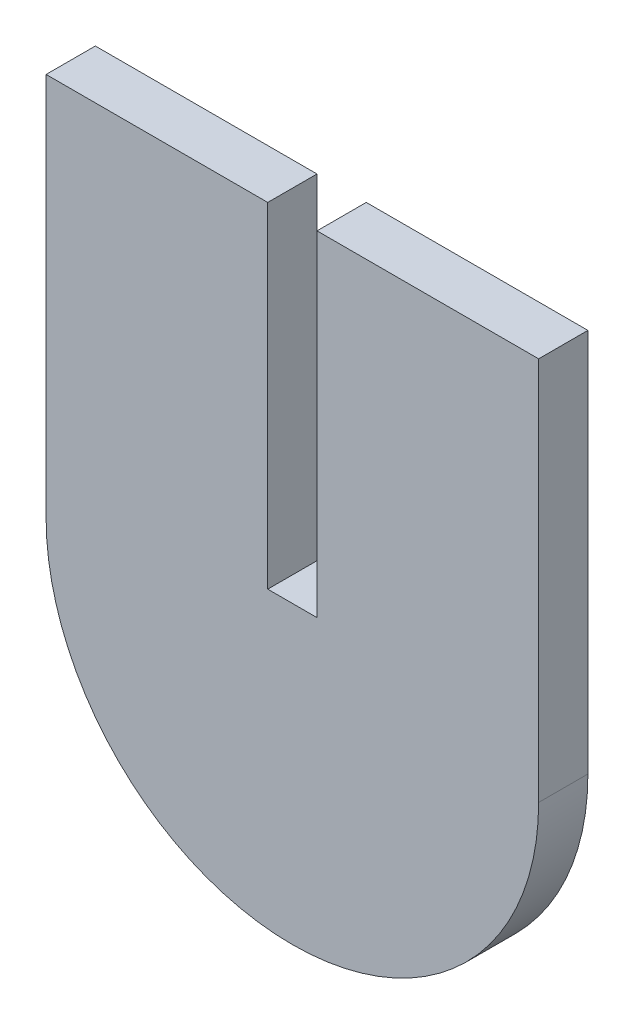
from build123d import *

# Parameters (mm, degrees)
BOSS_EXTRUDE1_DEPTH = 3.175
SKETCH2_W           = 3.175
SKETCH2_H           = 3.175
CUT_EXTRUDE1_DEPTH  = 34.953207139
SKETCH3_W           = 25.4
SKETCH3_H           = 3.175
CUT_EXTRUDE2_DEPTH  = 34.953207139
SKETCH4_W           = 3.175
SKETCH4_H           = 21.59
CUT_EXTRUDE3_DEPTH  = 34.953207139


with BuildPart() as part:
    # Sketch1 → Boss-Extrude1 (new body)
    with BuildSketch(Plane.XY):
        with BuildLine():
            Line((-15.875, 13.97), (15.875, 13.97))
            Line((15.875, 13.97), (15.875, -13.97))
            ThreePointArc((15.875, -13.97), (0, -29.845), (-15.875, -13.97))
            Line((-15.875, -13.97), (-15.875, 13.97))
        make_face()
    extrude(amount=BOSS_EXTRUDE1_DEPTH)

    # Sketch2 → Cut-Extrude1 (cut, through all)
    with BuildSketch(Plane.XY.offset(3.175)):
        with Locations((-14.2875, 12.3825)):
            Rectangle(SKETCH2_W, SKETCH2_H)
        with Locations((14.2875, 12.3825)):
            Rectangle(SKETCH2_W, SKETCH2_H)
    extrude(amount=-CUT_EXTRUDE1_DEPTH, mode=Mode.SUBTRACT)

    # Sketch3 → Cut-Extrude2 (cut, through all)
    with BuildSketch(Plane.XY.offset(3.175)):
        with Locations((0, 12.3825)):
            Rectangle(SKETCH3_W, SKETCH3_H)
    extrude(amount=-CUT_EXTRUDE2_DEPTH, mode=Mode.SUBTRACT)

    # Sketch4 → Cut-Extrude3 (cut, through all)
    with BuildSketch(Plane.XY.offset(3.175)):
        Rectangle(SKETCH4_W, SKETCH4_H)
    extrude(amount=-CUT_EXTRUDE3_DEPTH, mode=Mode.SUBTRACT)


solid = part.part
